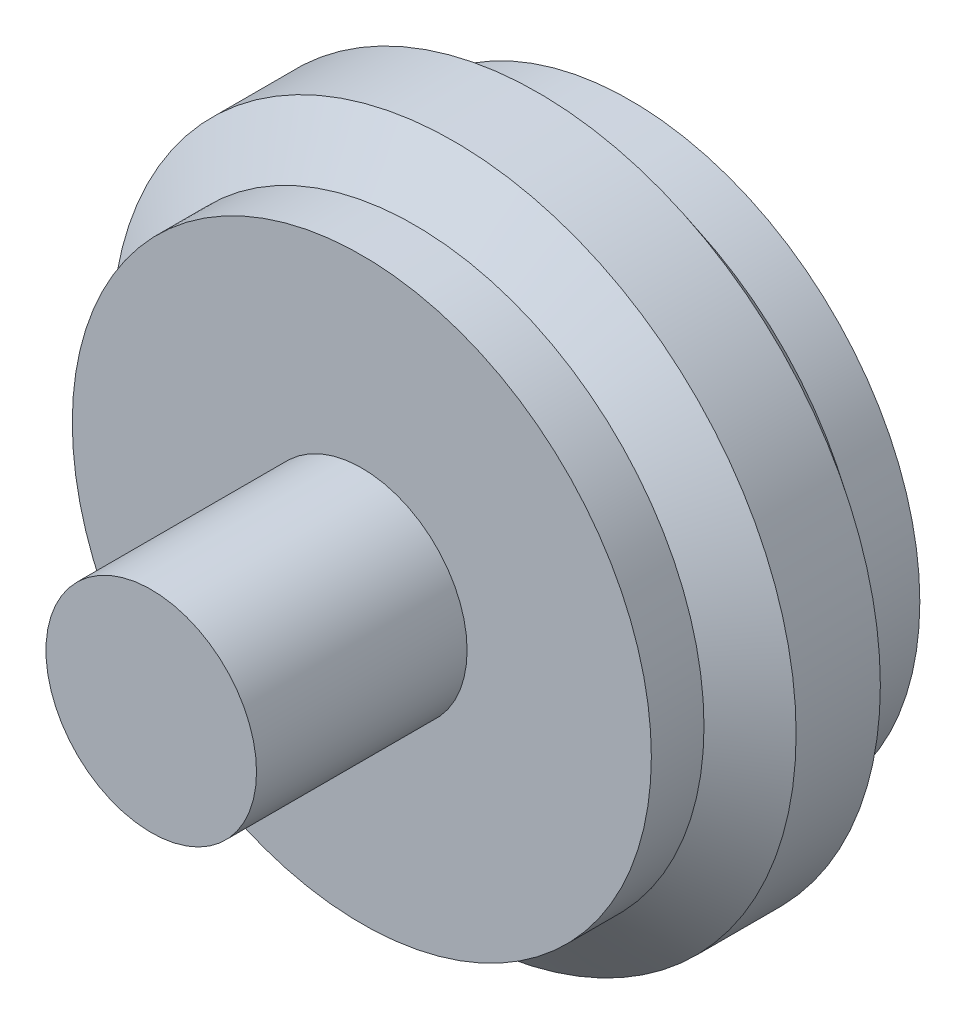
from build123d import *

# Parameters (mm, degrees)
SKETCH_2_R      = 4
EXTRUDE_1_DEPTH = 10
SKETCH_3_R      = 11
EXTRUDE_2_DEPTH = 2
EXTRUDE_START   = 2
SKETCH_4_R      = 11
EXTRUDE_3_DEPTH = 2


with BuildPart() as part:
    # Sketch 1 → Revolve 1 (revolve)
    with BuildSketch(Plane(origin=(0, 0, 0), x_dir=(1, 0, 0), z_dir=(0, 1, 0))):
        Polygon((0, 0), (11, 0), (13, 1.5), (13, 4.7), (11, 6.2), (0, 6.2), align=None)
    revolve(axis=Axis((0, 0, 0), (0, 0, -1)))

    # Sketch 2 → Extrude 1 (add)
    with BuildSketch(Plane.XY):
        Circle(SKETCH_2_R)
    extrude(amount=EXTRUDE_1_DEPTH)

    # Sketch 3 → Extrude 2 (add)
    with BuildSketch(Plane.XY):
        Circle(SKETCH_3_R)
    extrude(amount=EXTRUDE_2_DEPTH)

    # Sketch 4 → Extrude 3 (add)
    with BuildSketch(Plane(origin=(0, 0, -6.2), x_dir=(-1, 0, 0), z_dir=(0, 0, -1)).offset(EXTRUDE_START)):
        with Locations(Location((0, 0, 0), (0, 0, 180))):
            Circle(SKETCH_4_R)
    extrude(amount=-EXTRUDE_3_DEPTH)


solid = part.part
